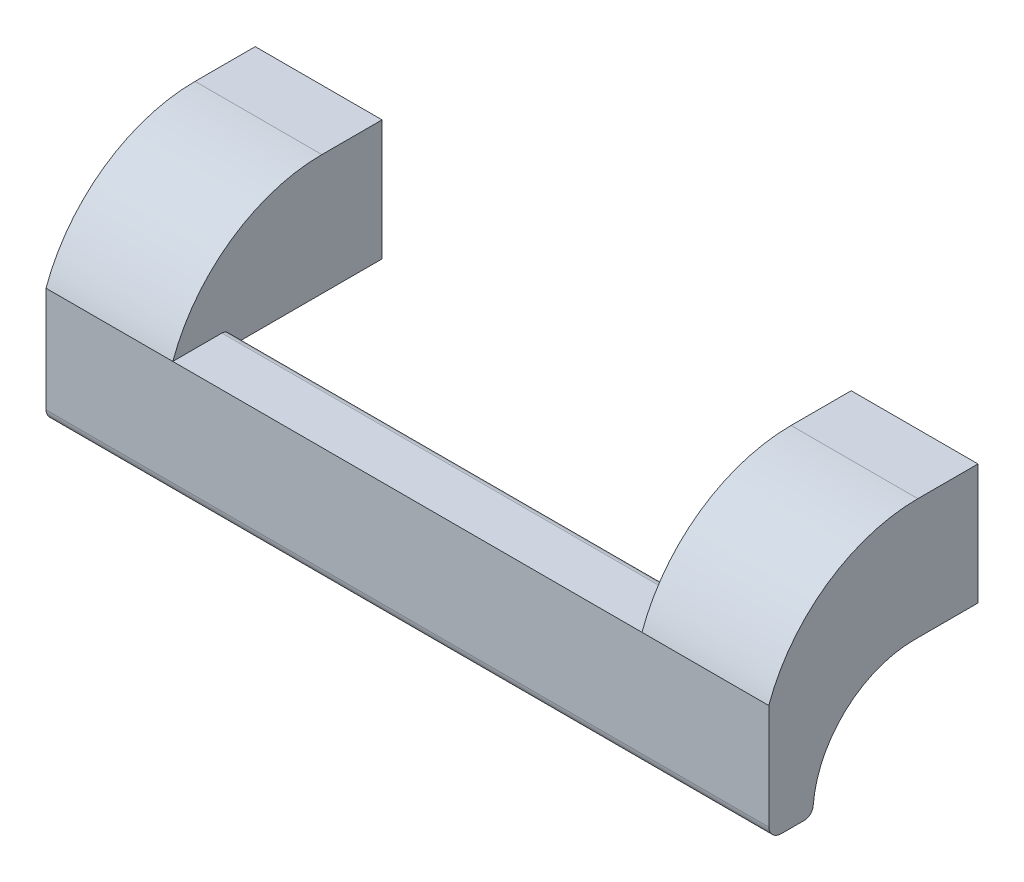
ISO-10303-21;
HEADER;
FILE_DESCRIPTION(('STEP AP214'),'2;1');
FILE_NAME('part.step','',(''),(''),'','','');
FILE_SCHEMA(('AUTOMOTIVE_DESIGN { 1 0 10303 214 1 1 1 1 }'));
ENDSEC;
DATA;
#1=APPLICATION_CONTEXT('core data for automotive mechanical design processes');
#2=APPLICATION_PROTOCOL_DEFINITION('international standard','automotive_design',2000,#1);
#3=PRODUCT_CONTEXT('',#1,'mechanical');
#4=PRODUCT('Part','Part','',(#3));
#5=PRODUCT_RELATED_PRODUCT_CATEGORY('part','',(#4));
#6=PRODUCT_DEFINITION_FORMATION('','',#4);
#7=PRODUCT_DEFINITION_CONTEXT('part definition',#1,'design');
#8=PRODUCT_DEFINITION('design','',#6,#7);
#9=PRODUCT_DEFINITION_SHAPE('','',#8);
#10=(LENGTH_UNIT() NAMED_UNIT(*) SI_UNIT(.MILLI.,.METRE.));
#11=(NAMED_UNIT(*) PLANE_ANGLE_UNIT() SI_UNIT($,.RADIAN.));
#12=(NAMED_UNIT(*) SI_UNIT($,.STERADIAN.) SOLID_ANGLE_UNIT());
#13=UNCERTAINTY_MEASURE_WITH_UNIT(LENGTH_MEASURE(1.E-05),#10,'distance_accuracy_value','');
#14=(GEOMETRIC_REPRESENTATION_CONTEXT(3) GLOBAL_UNCERTAINTY_ASSIGNED_CONTEXT((#13)) GLOBAL_UNIT_ASSIGNED_CONTEXT((#10,
#11,#12)) REPRESENTATION_CONTEXT('',''));
#15=CARTESIAN_POINT('',(0.,0.,0.));
#16=DIRECTION('',(0.,0.,1.));
#17=DIRECTION('',(1.,0.,0.));
#18=AXIS2_PLACEMENT_3D('',#15,#16,#17);
#19=CARTESIAN_POINT('',(-10.25,-9.49999999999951,1.94289029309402E-13));
#20=DIRECTION('',(0.,0.,-1.));
#21=DIRECTION('',(1.,0.,0.));
#22=AXIS2_PLACEMENT_3D('',#19,#20,#21);
#23=PLANE('',#22);
#24=DIRECTION('',(1.,0.,0.));
#25=VECTOR('',#24,1.);
#26=CARTESIAN_POINT('',(-10.25,-9.49999999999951,1.94289029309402E-13));
#27=LINE('',#26,#25);
#28=CARTESIAN_POINT('',(83.75,-9.49999999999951,1.94289029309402E-13));
#29=VERTEX_POINT('',#28);
#30=CARTESIAN_POINT('',(103.75,-9.49999999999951,1.94289029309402E-13));
#31=VERTEX_POINT('',#30);
#32=EDGE_CURVE('E184',#29,#31,#27,.T.);
#33=ORIENTED_EDGE('',*,*,#32,.F.);
#34=DIRECTION('',(0.,-1.,0.));
#35=VECTOR('',#34,1.);
#36=CARTESIAN_POINT('',(83.75,10.763352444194,-2.08166817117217E-13));
#37=LINE('',#36,#35);
#38=CARTESIAN_POINT('',(83.75,9.5,-1.80411241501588E-13));
#39=VERTEX_POINT('',#38);
#40=EDGE_CURVE('E359',#39,#29,#37,.T.);
#41=ORIENTED_EDGE('',*,*,#40,.F.);
#42=DIRECTION('',(1.,0.,0.));
#43=VECTOR('',#42,1.);
#44=CARTESIAN_POINT('',(-10.25,9.5,-1.80411241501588E-13));
#45=LINE('',#44,#43);
#46=CARTESIAN_POINT('',(103.75,9.5,-1.80411241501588E-13));
#47=VERTEX_POINT('',#46);
#48=EDGE_CURVE('E183',#39,#47,#45,.T.);
#49=ORIENTED_EDGE('',*,*,#48,.T.);
#50=DIRECTION('',(0.,1.,0.));
#51=VECTOR('',#50,1.);
#52=CARTESIAN_POINT('',(103.75,-9.49999999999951,1.94289029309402E-13));
#53=LINE('',#52,#51);
#54=EDGE_CURVE('E215',#31,#47,#53,.T.);
#55=ORIENTED_EDGE('',*,*,#54,.F.);
#56=EDGE_LOOP('',(#33,#41,#49,#55));
#57=FACE_BOUND('',#56,.T.);
#58=CARTESIAN_POINT('',(93.5,0.,0.));
#59=DIRECTION('',(0.,0.,1.));
#60=DIRECTION('',(-1.,0.,0.));
#61=AXIS2_PLACEMENT_3D('',#58,#59,#60);
#62=CIRCLE('',#61,3.25);
#63=CARTESIAN_POINT('',(90.25,0.,0.));
#64=VERTEX_POINT('',#63);
#65=EDGE_CURVE('E371',#64,#64,#62,.T.);
#66=ORIENTED_EDGE('',*,*,#65,.T.);
#67=EDGE_LOOP('',(#66));
#68=FACE_BOUND('',#67,.T.);
#69=ADVANCED_FACE('F14',(#57,#68),#23,.T.);
#70=DIRECTION('',(0.,-1.,0.));
#71=VECTOR('',#70,1.);
#72=CARTESIAN_POINT('',(9.75,10.763352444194,-2.08166817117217E-13));
#73=LINE('',#72,#71);
#74=CARTESIAN_POINT('',(9.75,9.5,-1.80411241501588E-13));
#75=VERTEX_POINT('',#74);
#76=CARTESIAN_POINT('',(9.75,-9.49999999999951,1.94289029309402E-13));
#77=VERTEX_POINT('',#76);
#78=EDGE_CURVE('E160',#75,#77,#73,.T.);
#79=ORIENTED_EDGE('',*,*,#78,.T.);
#80=CARTESIAN_POINT('',(-10.25,-9.49999999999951,1.94289029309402E-13));
#81=VERTEX_POINT('',#80);
#82=EDGE_CURVE('E173',#81,#77,#27,.T.);
#83=ORIENTED_EDGE('',*,*,#82,.F.);
#84=DIRECTION('',(0.,1.,0.));
#85=VECTOR('',#84,1.);
#86=CARTESIAN_POINT('',(-10.25,-9.49999999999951,1.94289029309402E-13));
#87=LINE('',#86,#85);
#88=CARTESIAN_POINT('',(-10.25,9.5,-1.80411241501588E-13));
#89=VERTEX_POINT('',#88);
#90=EDGE_CURVE('E243',#81,#89,#87,.T.);
#91=ORIENTED_EDGE('',*,*,#90,.T.);
#92=EDGE_CURVE('E175',#89,#75,#45,.T.);
#93=ORIENTED_EDGE('',*,*,#92,.T.);
#94=EDGE_LOOP('',(#79,#83,#91,#93));
#95=FACE_BOUND('',#94,.T.);
#96=CARTESIAN_POINT('',(0.,0.,0.));
#97=DIRECTION('',(0.,0.,-1.));
#98=DIRECTION('',(1.,0.,0.));
#99=AXIS2_PLACEMENT_3D('',#96,#97,#98);
#100=CIRCLE('',#99,3.25);
#101=CARTESIAN_POINT('',(3.25,0.,0.));
#102=VERTEX_POINT('',#101);
#103=EDGE_CURVE('E176',#102,#102,#100,.T.);
#104=ORIENTED_EDGE('',*,*,#103,.F.);
#105=EDGE_LOOP('',(#104));
#106=FACE_BOUND('',#105,.T.);
#107=ADVANCED_FACE('F170',(#95,#106),#23,.T.);
#108=CARTESIAN_POINT('',(-10.25,-15.4999999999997,9.48936410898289));
#109=DIRECTION('',(1.,0.,0.));
#110=DIRECTION('',(0.,1.,0.));
#111=AXIS2_PLACEMENT_3D('',#108,#109,#110);
#112=CYLINDRICAL_SURFACE('',#111,25.);
#113=CARTESIAN_POINT('',(83.75,-15.4999999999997,9.48936410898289));
#114=DIRECTION('',(-1.,0.,0.));
#115=DIRECTION('',(0.,-1.,0.));
#116=AXIS2_PLACEMENT_3D('',#113,#114,#115);
#117=CIRCLE('',#116,25.);
#118=CARTESIAN_POINT('',(83.75,-6.99999999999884,33.0000000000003));
#119=VERTEX_POINT('',#118);
#120=CARTESIAN_POINT('',(83.75,9.50000000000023,9.48936410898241));
#121=VERTEX_POINT('',#120);
#122=EDGE_CURVE('E340',#119,#121,#117,.T.);
#123=ORIENTED_EDGE('',*,*,#122,.F.);
#124=DIRECTION('',(1.,0.,0.));
#125=VECTOR('',#124,1.);
#126=CARTESIAN_POINT('',(-10.25,-6.99999999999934,33.0000000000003));
#127=LINE('',#126,#125);
#128=CARTESIAN_POINT('',(103.75,-6.99999999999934,33.0000000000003));
#129=VERTEX_POINT('',#128);
#130=EDGE_CURVE('E206',#119,#129,#127,.T.);
#131=ORIENTED_EDGE('',*,*,#130,.T.);
#132=CARTESIAN_POINT('',(103.75,-15.4999999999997,9.48936410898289));
#133=DIRECTION('',(-1.,0.,0.));
#134=DIRECTION('',(0.,-1.,0.));
#135=AXIS2_PLACEMENT_3D('',#132,#133,#134);
#136=CIRCLE('',#135,25.);
#137=CARTESIAN_POINT('',(103.75,9.50000000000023,9.48936410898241));
#138=VERTEX_POINT('',#137);
#139=EDGE_CURVE('E203',#129,#138,#136,.T.);
#140=ORIENTED_EDGE('',*,*,#139,.T.);
#141=DIRECTION('',(1.,0.,0.));
#142=VECTOR('',#141,1.);
#143=CARTESIAN_POINT('',(-10.25,9.50000000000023,9.48936410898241));
#144=LINE('',#143,#142);
#145=EDGE_CURVE('E22',#121,#138,#144,.T.);
#146=ORIENTED_EDGE('',*,*,#145,.F.);
#147=EDGE_LOOP('',(#123,#131,#140,#146));
#148=FACE_BOUND('',#147,.T.);
#149=ADVANCED_FACE('F204',(#148),#112,.T.);
#150=CARTESIAN_POINT('',(-10.25,9.5,-1.80411241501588E-13));
#151=DIRECTION('',(0.,1.,0.));
#152=DIRECTION('',(-1.,0.,0.));
#153=AXIS2_PLACEMENT_3D('',#150,#151,#152);
#154=PLANE('',#153);
#155=ORIENTED_EDGE('',*,*,#48,.F.);
#156=DIRECTION('',(0.,0.,1.));
#157=VECTOR('',#156,1.);
#158=CARTESIAN_POINT('',(83.75,9.5,-1.80411241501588E-13));
#159=LINE('',#158,#157);
#160=EDGE_CURVE('E199',#39,#121,#159,.T.);
#161=ORIENTED_EDGE('',*,*,#160,.T.);
#162=ORIENTED_EDGE('',*,*,#145,.T.);
#163=DIRECTION('',(0.,0.,1.));
#164=VECTOR('',#163,1.);
#165=CARTESIAN_POINT('',(103.75,9.5,-1.80411241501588E-13));
#166=LINE('',#165,#164);
#167=EDGE_CURVE('E197',#47,#138,#166,.T.);
#168=ORIENTED_EDGE('',*,*,#167,.F.);
#169=EDGE_LOOP('',(#155,#161,#162,#168));
#170=FACE_BOUND('',#169,.T.);
#171=ADVANCED_FACE('F195',(#170),#154,.T.);
#172=CARTESIAN_POINT('',(-10.25,-9.49999999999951,1.94289029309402E-13));
#173=DIRECTION('',(0.,1.,0.));
#174=DIRECTION('',(-1.,0.,0.));
#175=AXIS2_PLACEMENT_3D('',#172,#173,#174);
#176=PLANE('',#175);
#177=DIRECTION('',(0.,0.,-1.));
#178=VECTOR('',#177,1.);
#179=CARTESIAN_POINT('',(83.75,-9.49999999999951,25.2545902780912));
#180=LINE('',#179,#178);
#181=CARTESIAN_POINT('',(83.75,-9.49999999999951,25.2545902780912));
#182=VERTEX_POINT('',#181);
#183=EDGE_CURVE('E357',#182,#29,#180,.T.);
#184=ORIENTED_EDGE('',*,*,#183,.T.);
#185=ORIENTED_EDGE('',*,*,#32,.T.);
#186=DIRECTION('',(0.,0.,1.));
#187=VECTOR('',#186,1.);
#188=CARTESIAN_POINT('',(103.75,-9.49999999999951,1.94289029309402E-13));
#189=LINE('',#188,#187);
#190=CARTESIAN_POINT('',(103.75,-9.49999999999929,10.0519430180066));
#191=VERTEX_POINT('',#190);
#192=EDGE_CURVE('E217',#31,#191,#189,.T.);
#193=ORIENTED_EDGE('',*,*,#192,.T.);
#194=DIRECTION('',(1.,0.,0.));
#195=VECTOR('',#194,1.);
#196=CARTESIAN_POINT('',(-10.25,-9.49999999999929,10.0519430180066));
#197=LINE('',#196,#195);
#198=CARTESIAN_POINT('',(101.25,-9.49999999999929,10.0519430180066));
#199=VERTEX_POINT('',#198);
#200=EDGE_CURVE('E273',#199,#191,#197,.T.);
#201=ORIENTED_EDGE('',*,*,#200,.F.);
#202=DIRECTION('',(0.,0.,1.));
#203=VECTOR('',#202,1.);
#204=CARTESIAN_POINT('',(101.25,-9.49999999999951,-0.00996209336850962));
#205=LINE('',#204,#203);
#206=CARTESIAN_POINT('',(101.25,-9.4999999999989,30.0000000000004));
#207=VERTEX_POINT('',#206);
#208=EDGE_CURVE('E325',#199,#207,#205,.T.);
#209=ORIENTED_EDGE('',*,*,#208,.T.);
#210=DIRECTION('',(-1.,0.,0.));
#211=VECTOR('',#210,1.);
#212=CARTESIAN_POINT('',(101.25,-9.4999999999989,30.0000000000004));
#213=LINE('',#212,#211);
#214=CARTESIAN_POINT('',(-7.75,-9.4999999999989,30.0000000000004));
#215=VERTEX_POINT('',#214);
#216=EDGE_CURVE('E303',#207,#215,#213,.T.);
#217=ORIENTED_EDGE('',*,*,#216,.T.);
#218=DIRECTION('',(0.,0.,1.));
#219=VECTOR('',#218,1.);
#220=CARTESIAN_POINT('',(-7.75,-9.49999999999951,-0.00996209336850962));
#221=LINE('',#220,#219);
#222=CARTESIAN_POINT('',(-7.75,-9.49999999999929,10.0519430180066));
#223=VERTEX_POINT('',#222);
#224=EDGE_CURVE('E338',#223,#215,#221,.T.);
#225=ORIENTED_EDGE('',*,*,#224,.F.);
#226=CARTESIAN_POINT('',(-10.25,-9.49999999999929,10.0519430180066));
#227=VERTEX_POINT('',#226);
#228=EDGE_CURVE('E186',#227,#223,#197,.T.);
#229=ORIENTED_EDGE('',*,*,#228,.F.);
#230=DIRECTION('',(0.,0.,1.));
#231=VECTOR('',#230,1.);
#232=CARTESIAN_POINT('',(-10.25,-9.49999999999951,1.94289029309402E-13));
#233=LINE('',#232,#231);
#234=EDGE_CURVE('E182',#81,#227,#233,.T.);
#235=ORIENTED_EDGE('',*,*,#234,.F.);
#236=ORIENTED_EDGE('',*,*,#82,.T.);
#237=DIRECTION('',(0.,0.,-1.));
#238=VECTOR('',#237,1.);
#239=CARTESIAN_POINT('',(9.75,-9.49999999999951,25.2545902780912));
#240=LINE('',#239,#238);
#241=CARTESIAN_POINT('',(9.75,-9.49999999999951,25.2545902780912));
#242=VERTEX_POINT('',#241);
#243=EDGE_CURVE('E157',#242,#77,#240,.T.);
#244=ORIENTED_EDGE('',*,*,#243,.F.);
#245=DIRECTION('',(-1.,0.,0.));
#246=VECTOR('',#245,1.);
#247=CARTESIAN_POINT('',(83.75,-9.49999999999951,25.2545902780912));
#248=LINE('',#247,#246);
#249=EDGE_CURVE('E350',#182,#242,#248,.T.);
#250=ORIENTED_EDGE('',*,*,#249,.F.);
#251=EDGE_LOOP('',(#184,#185,#193,#201,#209,#217,#225,#229,#235,#236,#244,#250));
#252=FACE_BOUND('',#251,.T.);
#253=ADVANCED_FACE('F180',(#252),#176,.F.);
#254=CARTESIAN_POINT('',(-10.25,-25.4999999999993,10.0519430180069));
#255=DIRECTION('',(1.,0.,0.));
#256=DIRECTION('',(0.,1.,0.));
#257=AXIS2_PLACEMENT_3D('',#254,#255,#256);
#258=CYLINDRICAL_SURFACE('',#257,16.);
#259=DIRECTION('',(1.,0.,0.));
#260=VECTOR('',#259,1.);
#261=CARTESIAN_POINT('',(-10.25,-24.2117925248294,26.0000000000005));
#262=LINE('',#261,#260);
#263=CARTESIAN_POINT('',(101.25,-24.2117925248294,26.0000000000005));
#264=VERTEX_POINT('',#263);
#265=CARTESIAN_POINT('',(103.75,-24.2117925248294,26.0000000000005));
#266=VERTEX_POINT('',#265);
#267=EDGE_CURVE('E270',#264,#266,#262,.T.);
#268=ORIENTED_EDGE('',*,*,#267,.F.);
#269=CARTESIAN_POINT('',(101.25,-25.4999999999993,10.0519430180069));
#270=DIRECTION('',(-1.,0.,0.));
#271=DIRECTION('',(0.,-1.,0.));
#272=AXIS2_PLACEMENT_3D('',#269,#270,#271);
#273=CIRCLE('',#272,16.);
#274=EDGE_CURVE('E210',#264,#199,#273,.T.);
#275=ORIENTED_EDGE('',*,*,#274,.T.);
#276=ORIENTED_EDGE('',*,*,#200,.T.);
#277=CARTESIAN_POINT('',(103.75,-25.4999999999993,10.0519430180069));
#278=DIRECTION('',(-1.,0.,0.));
#279=DIRECTION('',(0.,-1.,0.));
#280=AXIS2_PLACEMENT_3D('',#277,#278,#279);
#281=CIRCLE('',#280,16.);
#282=EDGE_CURVE('E223',#266,#191,#281,.T.);
#283=ORIENTED_EDGE('',*,*,#282,.F.);
#284=EDGE_LOOP('',(#268,#275,#276,#283));
#285=FACE_BOUND('',#284,.T.);
#286=ADVANCED_FACE('F285',(#285),#258,.F.);
#287=CARTESIAN_POINT('',(-10.25,-6.99999999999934,33.0000000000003));
#288=VERTEX_POINT('',#287);
#289=CARTESIAN_POINT('',(9.75,-6.99999999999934,33.0000000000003));
#290=VERTEX_POINT('',#289);
#291=EDGE_CURVE('E261',#288,#290,#127,.T.);
#292=ORIENTED_EDGE('',*,*,#291,.T.);
#293=CARTESIAN_POINT('',(9.75,-15.4999999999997,9.48936410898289));
#294=DIRECTION('',(-1.,0.,0.));
#295=DIRECTION('',(0.,-1.,0.));
#296=AXIS2_PLACEMENT_3D('',#293,#294,#295);
#297=CIRCLE('',#296,25.);
#298=CARTESIAN_POINT('',(9.75,9.50000000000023,9.48936410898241));
#299=VERTEX_POINT('',#298);
#300=EDGE_CURVE('E343',#290,#299,#297,.T.);
#301=ORIENTED_EDGE('',*,*,#300,.T.);
#302=CARTESIAN_POINT('',(-10.25,9.50000000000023,9.48936410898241));
#303=VERTEX_POINT('',#302);
#304=EDGE_CURVE('E9',#303,#299,#144,.T.);
#305=ORIENTED_EDGE('',*,*,#304,.F.);
#306=CARTESIAN_POINT('',(-10.25,-15.4999999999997,9.48936410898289));
#307=DIRECTION('',(-1.,0.,0.));
#308=DIRECTION('',(0.,-1.,0.));
#309=AXIS2_PLACEMENT_3D('',#306,#307,#308);
#310=CIRCLE('',#309,25.);
#311=EDGE_CURVE('E237',#288,#303,#310,.T.);
#312=ORIENTED_EDGE('',*,*,#311,.F.);
#313=EDGE_LOOP('',(#292,#301,#305,#312));
#314=FACE_BOUND('',#313,.T.);
#315=ADVANCED_FACE('F417',(#314),#112,.T.);
#316=DIRECTION('',(0.,0.,1.));
#317=VECTOR('',#316,1.);
#318=CARTESIAN_POINT('',(9.75,9.5,-1.80411241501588E-13));
#319=LINE('',#318,#317);
#320=EDGE_CURVE('E346',#75,#299,#319,.T.);
#321=ORIENTED_EDGE('',*,*,#320,.F.);
#322=ORIENTED_EDGE('',*,*,#92,.F.);
#323=DIRECTION('',(0.,0.,1.));
#324=VECTOR('',#323,1.);
#325=CARTESIAN_POINT('',(-10.25,9.5,-1.80411241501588E-13));
#326=LINE('',#325,#324);
#327=EDGE_CURVE('E240',#89,#303,#326,.T.);
#328=ORIENTED_EDGE('',*,*,#327,.T.);
#329=ORIENTED_EDGE('',*,*,#304,.T.);
#330=EDGE_LOOP('',(#321,#322,#328,#329));
#331=FACE_BOUND('',#330,.T.);
#332=ADVANCED_FACE('F16',(#331),#154,.T.);
#333=CARTESIAN_POINT('',(-7.75,-25.4999999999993,10.0519430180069));
#334=DIRECTION('',(-1.,0.,0.));
#335=DIRECTION('',(0.,-1.,0.));
#336=AXIS2_PLACEMENT_3D('',#333,#334,#335);
#337=CIRCLE('',#336,16.);
#338=CARTESIAN_POINT('',(-7.75,-24.2117925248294,26.));
#339=VERTEX_POINT('',#338);
#340=EDGE_CURVE('E299',#339,#223,#337,.T.);
#341=ORIENTED_EDGE('',*,*,#340,.F.);
#342=CARTESIAN_POINT('',(-10.25,-24.2117925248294,26.0000000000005));
#343=VERTEX_POINT('',#342);
#344=EDGE_CURVE('E271',#343,#339,#262,.T.);
#345=ORIENTED_EDGE('',*,*,#344,.F.);
#346=CARTESIAN_POINT('',(-10.25,-25.4999999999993,10.0519430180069));
#347=DIRECTION('',(-1.,0.,0.));
#348=DIRECTION('',(0.,-1.,0.));
#349=AXIS2_PLACEMENT_3D('',#346,#347,#348);
#350=CIRCLE('',#349,16.);
#351=EDGE_CURVE('E246',#343,#227,#350,.T.);
#352=ORIENTED_EDGE('',*,*,#351,.T.);
#353=ORIENTED_EDGE('',*,*,#228,.T.);
#354=EDGE_LOOP('',(#341,#345,#352,#353));
#355=FACE_BOUND('',#354,.T.);
#356=ADVANCED_FACE('F298',(#355),#258,.F.);
#357=CARTESIAN_POINT('',(-10.25,-24.0989933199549,27.3964583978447));
#358=DIRECTION('',(1.,0.,0.));
#359=DIRECTION('',(0.,1.,0.));
#360=AXIS2_PLACEMENT_3D('',#357,#358,#359);
#361=CYLINDRICAL_SURFACE('',#360,1.40100668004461);
#362=DIRECTION('',(1.,0.,0.));
#363=VECTOR('',#362,1.);
#364=CARTESIAN_POINT('',(-10.25,-25.4999999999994,27.3964583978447));
#365=LINE('',#364,#363);
#366=CARTESIAN_POINT('',(-10.25,-25.4999999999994,27.3964583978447));
#367=VERTEX_POINT('',#366);
#368=CARTESIAN_POINT('',(103.75,-25.4999999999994,27.3964583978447));
#369=VERTEX_POINT('',#368);
#370=EDGE_CURVE('E269',#367,#369,#365,.T.);
#371=ORIENTED_EDGE('',*,*,#370,.F.);
#372=CARTESIAN_POINT('',(-10.25,-24.0989933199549,27.3964583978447));
#373=DIRECTION('',(-1.,0.,0.));
#374=DIRECTION('',(0.,-1.,0.));
#375=AXIS2_PLACEMENT_3D('',#372,#373,#374);
#376=CIRCLE('',#375,1.40100668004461);
#377=EDGE_CURVE('E249',#343,#367,#376,.T.);
#378=ORIENTED_EDGE('',*,*,#377,.F.);
#379=ORIENTED_EDGE('',*,*,#344,.T.);
#380=DIRECTION('',(-1.,0.,0.));
#381=VECTOR('',#380,1.);
#382=CARTESIAN_POINT('',(101.25,-24.2117925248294,26.));
#383=LINE('',#382,#381);
#384=EDGE_CURVE('E282',#264,#339,#383,.T.);
#385=ORIENTED_EDGE('',*,*,#384,.F.);
#386=ORIENTED_EDGE('',*,*,#267,.T.);
#387=CARTESIAN_POINT('',(103.75,-24.0989933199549,27.3964583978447));
#388=DIRECTION('',(-1.,0.,0.));
#389=DIRECTION('',(0.,-1.,0.));
#390=AXIS2_PLACEMENT_3D('',#387,#388,#389);
#391=CIRCLE('',#390,1.40100668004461);
#392=EDGE_CURVE('E226',#266,#369,#391,.T.);
#393=ORIENTED_EDGE('',*,*,#392,.T.);
#394=EDGE_LOOP('',(#371,#378,#379,#385,#386,#393));
#395=FACE_BOUND('',#394,.T.);
#396=ADVANCED_FACE('F279',(#395),#361,.T.);
#397=CARTESIAN_POINT('',(-10.25,-25.4999999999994,27.3964583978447));
#398=DIRECTION('',(0.,1.,0.));
#399=DIRECTION('',(-1.,0.,0.));
#400=AXIS2_PLACEMENT_3D('',#397,#398,#399);
#401=PLANE('',#400);
#402=DIRECTION('',(1.,0.,0.));
#403=VECTOR('',#402,1.);
#404=CARTESIAN_POINT('',(-10.25,-25.4999999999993,31.0031268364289));
#405=LINE('',#404,#403);
#406=CARTESIAN_POINT('',(-10.25,-25.4999999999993,31.0031268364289));
#407=VERTEX_POINT('',#406);
#408=CARTESIAN_POINT('',(103.75,-25.4999999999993,31.0031268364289));
#409=VERTEX_POINT('',#408);
#410=EDGE_CURVE('E267',#407,#409,#405,.T.);
#411=ORIENTED_EDGE('',*,*,#410,.F.);
#412=DIRECTION('',(0.,0.,1.));
#413=VECTOR('',#412,1.);
#414=CARTESIAN_POINT('',(-10.25,-25.4999999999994,27.3964583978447));
#415=LINE('',#414,#413);
#416=EDGE_CURVE('E252',#367,#407,#415,.T.);
#417=ORIENTED_EDGE('',*,*,#416,.F.);
#418=ORIENTED_EDGE('',*,*,#370,.T.);
#419=DIRECTION('',(0.,0.,1.));
#420=VECTOR('',#419,1.);
#421=CARTESIAN_POINT('',(103.75,-25.4999999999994,27.3964583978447));
#422=LINE('',#421,#420);
#423=EDGE_CURVE('E229',#369,#409,#422,.T.);
#424=ORIENTED_EDGE('',*,*,#423,.T.);
#425=EDGE_LOOP('',(#411,#417,#418,#424));
#426=FACE_BOUND('',#425,.T.);
#427=ADVANCED_FACE('F289',(#426),#401,.F.);
#428=CARTESIAN_POINT('',(-10.25,-23.4999999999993,31.0031268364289));
#429=DIRECTION('',(1.,0.,0.));
#430=DIRECTION('',(0.,1.,0.));
#431=AXIS2_PLACEMENT_3D('',#428,#429,#430);
#432=CYLINDRICAL_SURFACE('',#431,2.00000000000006);
#433=DIRECTION('',(1.,0.,0.));
#434=VECTOR('',#433,1.);
#435=CARTESIAN_POINT('',(-10.25,-23.6117925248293,33.0000000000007));
#436=LINE('',#435,#434);
#437=CARTESIAN_POINT('',(-10.25,-23.6117925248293,33.0000000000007));
#438=VERTEX_POINT('',#437);
#439=CARTESIAN_POINT('',(103.75,-23.6117925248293,33.0000000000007));
#440=VERTEX_POINT('',#439);
#441=EDGE_CURVE('E264',#438,#440,#436,.T.);
#442=ORIENTED_EDGE('',*,*,#441,.F.);
#443=CARTESIAN_POINT('',(-10.25,-23.4999999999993,31.0031268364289));
#444=DIRECTION('',(-1.,0.,0.));
#445=DIRECTION('',(0.,-1.,0.));
#446=AXIS2_PLACEMENT_3D('',#443,#444,#445);
#447=CIRCLE('',#446,2.00000000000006);
#448=EDGE_CURVE('E255',#407,#438,#447,.T.);
#449=ORIENTED_EDGE('',*,*,#448,.F.);
#450=ORIENTED_EDGE('',*,*,#410,.T.);
#451=CARTESIAN_POINT('',(103.75,-23.4999999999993,31.0031268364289));
#452=DIRECTION('',(-1.,0.,0.));
#453=DIRECTION('',(0.,-1.,0.));
#454=AXIS2_PLACEMENT_3D('',#451,#452,#453);
#455=CIRCLE('',#454,2.00000000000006);
#456=EDGE_CURVE('E232',#409,#440,#455,.T.);
#457=ORIENTED_EDGE('',*,*,#456,.T.);
#458=EDGE_LOOP('',(#442,#449,#450,#457));
#459=FACE_BOUND('',#458,.T.);
#460=ADVANCED_FACE('F409',(#459),#432,.T.);
#461=CARTESIAN_POINT('',(-10.25,-23.6117925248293,33.0000000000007));
#462=DIRECTION('',(0.,0.,-1.));
#463=DIRECTION('',(1.,0.,0.));
#464=AXIS2_PLACEMENT_3D('',#461,#462,#463);
#465=PLANE('',#464);
#466=DIRECTION('',(0.,1.,0.));
#467=VECTOR('',#466,1.);
#468=CARTESIAN_POINT('',(-10.25,-23.6117925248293,33.0000000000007));
#469=LINE('',#468,#467);
#470=EDGE_CURVE('E258',#438,#288,#469,.T.);
#471=ORIENTED_EDGE('',*,*,#470,.F.);
#472=ORIENTED_EDGE('',*,*,#441,.T.);
#473=DIRECTION('',(0.,1.,0.));
#474=VECTOR('',#473,1.);
#475=CARTESIAN_POINT('',(103.75,-23.6117925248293,33.0000000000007));
#476=LINE('',#475,#474);
#477=EDGE_CURVE('E235',#440,#129,#476,.T.);
#478=ORIENTED_EDGE('',*,*,#477,.T.);
#479=ORIENTED_EDGE('',*,*,#130,.F.);
#480=EDGE_CURVE('E265',#290,#119,#127,.T.);
#481=ORIENTED_EDGE('',*,*,#480,.F.);
#482=ORIENTED_EDGE('',*,*,#291,.F.);
#483=EDGE_LOOP('',(#471,#472,#478,#479,#481,#482));
#484=FACE_BOUND('',#483,.T.);
#485=ADVANCED_FACE('F412',(#484),#465,.F.);
#486=CARTESIAN_POINT('',(-10.25,-15.4999999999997,9.48936410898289));
#487=DIRECTION('',(-1.,0.,0.));
#488=DIRECTION('',(0.,-1.,0.));
#489=AXIS2_PLACEMENT_3D('',#486,#487,#488);
#490=PLANE('',#489);
#491=ORIENTED_EDGE('',*,*,#311,.T.);
#492=ORIENTED_EDGE('',*,*,#327,.F.);
#493=ORIENTED_EDGE('',*,*,#90,.F.);
#494=ORIENTED_EDGE('',*,*,#234,.T.);
#495=ORIENTED_EDGE('',*,*,#351,.F.);
#496=ORIENTED_EDGE('',*,*,#377,.T.);
#497=ORIENTED_EDGE('',*,*,#416,.T.);
#498=ORIENTED_EDGE('',*,*,#448,.T.);
#499=ORIENTED_EDGE('',*,*,#470,.T.);
#500=EDGE_LOOP('',(#491,#492,#493,#494,#495,#496,#497,#498,#499));
#501=FACE_BOUND('',#500,.T.);
#502=ADVANCED_FACE('F293',(#501),#490,.T.);
#503=CARTESIAN_POINT('',(103.75,-15.4999999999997,9.48936410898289));
#504=DIRECTION('',(-1.,0.,0.));
#505=DIRECTION('',(0.,-1.,0.));
#506=AXIS2_PLACEMENT_3D('',#503,#504,#505);
#507=PLANE('',#506);
#508=ORIENTED_EDGE('',*,*,#139,.F.);
#509=ORIENTED_EDGE('',*,*,#477,.F.);
#510=ORIENTED_EDGE('',*,*,#456,.F.);
#511=ORIENTED_EDGE('',*,*,#423,.F.);
#512=ORIENTED_EDGE('',*,*,#392,.F.);
#513=ORIENTED_EDGE('',*,*,#282,.T.);
#514=ORIENTED_EDGE('',*,*,#192,.F.);
#515=ORIENTED_EDGE('',*,*,#54,.T.);
#516=ORIENTED_EDGE('',*,*,#167,.T.);
#517=EDGE_LOOP('',(#508,#509,#510,#511,#512,#513,#514,#515,#516));
#518=FACE_BOUND('',#517,.T.);
#519=ADVANCED_FACE('F212',(#518),#507,.F.);
#520=CARTESIAN_POINT('',(101.25,-22.9999999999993,30.0000000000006));
#521=DIRECTION('',(0.,0.,1.));
#522=DIRECTION('',(-1.,0.,0.));
#523=AXIS2_PLACEMENT_3D('',#520,#521,#522);
#524=PLANE('',#523);
#525=DIRECTION('',(-1.,0.,0.));
#526=VECTOR('',#525,1.);
#527=CARTESIAN_POINT('',(101.25,-22.9999999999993,30.0000000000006));
#528=LINE('',#527,#526);
#529=CARTESIAN_POINT('',(101.25,-22.9999999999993,30.0000000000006));
#530=VERTEX_POINT('',#529);
#531=CARTESIAN_POINT('',(-7.75,-22.9999999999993,30.0000000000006));
#532=VERTEX_POINT('',#531);
#533=EDGE_CURVE('E306',#530,#532,#528,.T.);
#534=ORIENTED_EDGE('',*,*,#533,.T.);
#535=DIRECTION('',(0.,1.,0.));
#536=VECTOR('',#535,1.);
#537=CARTESIAN_POINT('',(-7.75,-22.9999999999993,30.0000000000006));
#538=LINE('',#537,#536);
#539=EDGE_CURVE('E335',#532,#215,#538,.T.);
#540=ORIENTED_EDGE('',*,*,#539,.T.);
#541=ORIENTED_EDGE('',*,*,#216,.F.);
#542=DIRECTION('',(0.,1.,0.));
#543=VECTOR('',#542,1.);
#544=CARTESIAN_POINT('',(101.25,-22.9999999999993,30.0000000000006));
#545=LINE('',#544,#543);
#546=EDGE_CURVE('E322',#530,#207,#545,.T.);
#547=ORIENTED_EDGE('',*,*,#546,.F.);
#548=EDGE_LOOP('',(#534,#540,#541,#547));
#549=FACE_BOUND('',#548,.T.);
#550=ADVANCED_FACE('F425',(#549),#524,.F.);
#551=CARTESIAN_POINT('',(101.25,-22.9999999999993,29.5000000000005));
#552=DIRECTION('',(-1.,0.,0.));
#553=DIRECTION('',(0.,-1.,0.));
#554=AXIS2_PLACEMENT_3D('',#551,#552,#553);
#555=CYLINDRICAL_SURFACE('',#554,0.500000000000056);
#556=DIRECTION('',(-1.,0.,0.));
#557=VECTOR('',#556,1.);
#558=CARTESIAN_POINT('',(101.25,-23.4999999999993,29.5000000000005));
#559=LINE('',#558,#557);
#560=CARTESIAN_POINT('',(101.25,-23.4999999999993,29.5000000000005));
#561=VERTEX_POINT('',#560);
#562=CARTESIAN_POINT('',(-7.75,-23.4999999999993,29.5000000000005));
#563=VERTEX_POINT('',#562);
#564=EDGE_CURVE('E310',#561,#563,#559,.T.);
#565=ORIENTED_EDGE('',*,*,#564,.T.);
#566=CARTESIAN_POINT('',(-7.75,-22.9999999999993,29.5000000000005));
#567=DIRECTION('',(-1.,0.,0.));
#568=DIRECTION('',(0.,-1.,0.));
#569=AXIS2_PLACEMENT_3D('',#566,#567,#568);
#570=CIRCLE('',#569,0.500000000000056);
#571=EDGE_CURVE('E332',#563,#532,#570,.T.);
#572=ORIENTED_EDGE('',*,*,#571,.T.);
#573=ORIENTED_EDGE('',*,*,#533,.F.);
#574=CARTESIAN_POINT('',(101.25,-22.9999999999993,29.5000000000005));
#575=DIRECTION('',(-1.,0.,0.));
#576=DIRECTION('',(0.,-1.,0.));
#577=AXIS2_PLACEMENT_3D('',#574,#575,#576);
#578=CIRCLE('',#577,0.500000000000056);
#579=EDGE_CURVE('E319',#561,#530,#578,.T.);
#580=ORIENTED_EDGE('',*,*,#579,.F.);
#581=EDGE_LOOP('',(#565,#572,#573,#580));
#582=FACE_BOUND('',#581,.T.);
#583=ADVANCED_FACE('F428',(#582),#555,.F.);
#584=CARTESIAN_POINT('',(101.25,-23.4999999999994,26.7117925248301));
#585=DIRECTION('',(0.,-1.,0.));
#586=DIRECTION('',(0.,0.,1.));
#587=AXIS2_PLACEMENT_3D('',#584,#585,#586);
#588=PLANE('',#587);
#589=DIRECTION('',(-1.,0.,0.));
#590=VECTOR('',#589,1.);
#591=CARTESIAN_POINT('',(101.25,-23.4999999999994,26.7117925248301));
#592=LINE('',#591,#590);
#593=CARTESIAN_POINT('',(101.25,-23.4999999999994,26.7117925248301));
#594=VERTEX_POINT('',#593);
#595=CARTESIAN_POINT('',(-7.75,-23.4999999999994,26.7117925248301));
#596=VERTEX_POINT('',#595);
#597=EDGE_CURVE('E312',#594,#596,#592,.T.);
#598=ORIENTED_EDGE('',*,*,#597,.T.);
#599=DIRECTION('',(0.,0.,1.));
#600=VECTOR('',#599,1.);
#601=CARTESIAN_POINT('',(-7.75,-23.4999999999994,26.7117925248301));
#602=LINE('',#601,#600);
#603=EDGE_CURVE('E329',#596,#563,#602,.T.);
#604=ORIENTED_EDGE('',*,*,#603,.T.);
#605=ORIENTED_EDGE('',*,*,#564,.F.);
#606=DIRECTION('',(0.,0.,1.));
#607=VECTOR('',#606,1.);
#608=CARTESIAN_POINT('',(101.25,-23.4999999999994,26.7117925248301));
#609=LINE('',#608,#607);
#610=EDGE_CURVE('E316',#594,#561,#609,.T.);
#611=ORIENTED_EDGE('',*,*,#610,.F.);
#612=EDGE_LOOP('',(#598,#604,#605,#611));
#613=FACE_BOUND('',#612,.T.);
#614=ADVANCED_FACE('F432',(#613),#588,.F.);
#615=CARTESIAN_POINT('',(101.25,-24.2117925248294,26.7117925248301));
#616=DIRECTION('',(-1.,0.,0.));
#617=DIRECTION('',(0.,-1.,0.));
#618=AXIS2_PLACEMENT_3D('',#615,#616,#617);
#619=CYLINDRICAL_SURFACE('',#618,0.711792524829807);
#620=CARTESIAN_POINT('',(101.25,-24.2117925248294,26.7117925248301));
#621=DIRECTION('',(-1.,0.,0.));
#622=DIRECTION('',(0.,-1.,0.));
#623=AXIS2_PLACEMENT_3D('',#620,#621,#622);
#624=CIRCLE('',#623,0.711792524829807);
#625=EDGE_CURVE('E37',#594,#264,#624,.T.);
#626=ORIENTED_EDGE('',*,*,#625,.T.);
#627=ORIENTED_EDGE('',*,*,#384,.T.);
#628=CARTESIAN_POINT('',(-7.75,-24.2117925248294,26.7117925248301));
#629=DIRECTION('',(-1.,0.,0.));
#630=DIRECTION('',(0.,-1.,0.));
#631=AXIS2_PLACEMENT_3D('',#628,#629,#630);
#632=CIRCLE('',#631,0.711792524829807);
#633=EDGE_CURVE('E327',#596,#339,#632,.T.);
#634=ORIENTED_EDGE('',*,*,#633,.F.);
#635=ORIENTED_EDGE('',*,*,#597,.F.);
#636=EDGE_LOOP('',(#626,#627,#634,#635));
#637=FACE_BOUND('',#636,.T.);
#638=ADVANCED_FACE('F436',(#637),#619,.T.);
#639=CARTESIAN_POINT('',(101.25,-22.9999999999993,29.5000000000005));
#640=DIRECTION('',(-1.,0.,0.));
#641=DIRECTION('',(0.,-1.,0.));
#642=AXIS2_PLACEMENT_3D('',#639,#640,#641);
#643=PLANE('',#642);
#644=ORIENTED_EDGE('',*,*,#625,.F.);
#645=ORIENTED_EDGE('',*,*,#610,.T.);
#646=ORIENTED_EDGE('',*,*,#579,.T.);
#647=ORIENTED_EDGE('',*,*,#546,.T.);
#648=ORIENTED_EDGE('',*,*,#208,.F.);
#649=ORIENTED_EDGE('',*,*,#274,.F.);
#650=EDGE_LOOP('',(#644,#645,#646,#647,#648,#649));
#651=FACE_BOUND('',#650,.T.);
#652=ADVANCED_FACE('F438',(#651),#643,.T.);
#653=CARTESIAN_POINT('',(-7.75,-22.9999999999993,29.5000000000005));
#654=DIRECTION('',(-1.,0.,0.));
#655=DIRECTION('',(0.,-1.,0.));
#656=AXIS2_PLACEMENT_3D('',#653,#654,#655);
#657=PLANE('',#656);
#658=ORIENTED_EDGE('',*,*,#340,.T.);
#659=ORIENTED_EDGE('',*,*,#224,.T.);
#660=ORIENTED_EDGE('',*,*,#539,.F.);
#661=ORIENTED_EDGE('',*,*,#571,.F.);
#662=ORIENTED_EDGE('',*,*,#603,.F.);
#663=ORIENTED_EDGE('',*,*,#633,.T.);
#664=EDGE_LOOP('',(#658,#659,#660,#661,#662,#663));
#665=FACE_BOUND('',#664,.T.);
#666=ADVANCED_FACE('F441',(#665),#657,.F.);
#667=CARTESIAN_POINT('',(83.75,-6.99999999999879,34.0304898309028));
#668=DIRECTION('',(0.,1.,0.));
#669=DIRECTION('',(0.,0.,-1.));
#670=AXIS2_PLACEMENT_3D('',#667,#668,#669);
#671=PLANE('',#670);
#672=ORIENTED_EDGE('',*,*,#480,.T.);
#673=DIRECTION('',(0.,0.,-1.));
#674=VECTOR('',#673,1.);
#675=CARTESIAN_POINT('',(83.75,-6.99999999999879,34.0304898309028));
#676=LINE('',#675,#674);
#677=CARTESIAN_POINT('',(83.75,-6.99999999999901,25.2545902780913));
#678=VERTEX_POINT('',#677);
#679=EDGE_CURVE('E352',#119,#678,#676,.T.);
#680=ORIENTED_EDGE('',*,*,#679,.T.);
#681=DIRECTION('',(-1.,0.,0.));
#682=VECTOR('',#681,1.);
#683=CARTESIAN_POINT('',(83.75,-6.99999999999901,25.2545902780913));
#684=LINE('',#683,#682);
#685=CARTESIAN_POINT('',(9.75,-6.99999999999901,25.2545902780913));
#686=VERTEX_POINT('',#685);
#687=EDGE_CURVE('E348',#678,#686,#684,.T.);
#688=ORIENTED_EDGE('',*,*,#687,.T.);
#689=DIRECTION('',(0.,0.,-1.));
#690=VECTOR('',#689,1.);
#691=CARTESIAN_POINT('',(9.75,-6.99999999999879,34.0304898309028));
#692=LINE('',#691,#690);
#693=EDGE_CURVE('E29',#290,#686,#692,.T.);
#694=ORIENTED_EDGE('',*,*,#693,.F.);
#695=EDGE_LOOP('',(#672,#680,#688,#694));
#696=FACE_BOUND('',#695,.T.);
#697=ADVANCED_FACE('F447',(#696),#671,.T.);
#698=CARTESIAN_POINT('',(83.75,-8.24999999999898,25.2545902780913));
#699=DIRECTION('',(-1.,0.,0.));
#700=DIRECTION('',(0.,-1.,0.));
#701=AXIS2_PLACEMENT_3D('',#698,#699,#700);
#702=PLANE('',#701);
#703=ORIENTED_EDGE('',*,*,#122,.T.);
#704=ORIENTED_EDGE('',*,*,#160,.F.);
#705=ORIENTED_EDGE('',*,*,#40,.T.);
#706=ORIENTED_EDGE('',*,*,#183,.F.);
#707=CARTESIAN_POINT('',(83.75,-8.24999999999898,25.2545902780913));
#708=DIRECTION('',(-1.,0.,0.));
#709=DIRECTION('',(0.,-1.,0.));
#710=AXIS2_PLACEMENT_3D('',#707,#708,#709);
#711=CIRCLE('',#710,1.25000000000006);
#712=EDGE_CURVE('E354',#678,#182,#711,.T.);
#713=ORIENTED_EDGE('',*,*,#712,.F.);
#714=ORIENTED_EDGE('',*,*,#679,.F.);
#715=EDGE_LOOP('',(#703,#704,#705,#706,#713,#714));
#716=FACE_BOUND('',#715,.T.);
#717=ADVANCED_FACE('F450',(#716),#702,.T.);
#718=CARTESIAN_POINT('',(9.75,-8.24999999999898,25.2545902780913));
#719=DIRECTION('',(-1.,0.,0.));
#720=DIRECTION('',(0.,-1.,0.));
#721=AXIS2_PLACEMENT_3D('',#718,#719,#720);
#722=PLANE('',#721);
#723=ORIENTED_EDGE('',*,*,#693,.T.);
#724=CARTESIAN_POINT('',(9.75,-8.24999999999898,25.2545902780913));
#725=DIRECTION('',(-1.,0.,0.));
#726=DIRECTION('',(0.,-1.,0.));
#727=AXIS2_PLACEMENT_3D('',#724,#725,#726);
#728=CIRCLE('',#727,1.25000000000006);
#729=EDGE_CURVE('E163',#686,#242,#728,.T.);
#730=ORIENTED_EDGE('',*,*,#729,.T.);
#731=ORIENTED_EDGE('',*,*,#243,.T.);
#732=ORIENTED_EDGE('',*,*,#78,.F.);
#733=ORIENTED_EDGE('',*,*,#320,.T.);
#734=ORIENTED_EDGE('',*,*,#300,.F.);
#735=EDGE_LOOP('',(#723,#730,#731,#732,#733,#734));
#736=FACE_BOUND('',#735,.T.);
#737=ADVANCED_FACE('F159',(#736),#722,.F.);
#738=CARTESIAN_POINT('',(83.75,-8.24999999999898,25.2545902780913));
#739=DIRECTION('',(-1.,0.,0.));
#740=DIRECTION('',(0.,-1.,0.));
#741=AXIS2_PLACEMENT_3D('',#738,#739,#740);
#742=CYLINDRICAL_SURFACE('',#741,1.25000000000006);
#743=ORIENTED_EDGE('',*,*,#249,.T.);
#744=ORIENTED_EDGE('',*,*,#729,.F.);
#745=ORIENTED_EDGE('',*,*,#687,.F.);
#746=ORIENTED_EDGE('',*,*,#712,.T.);
#747=EDGE_LOOP('',(#743,#744,#745,#746));
#748=FACE_BOUND('',#747,.T.);
#749=ADVANCED_FACE('F451',(#748),#742,.T.);
#750=CARTESIAN_POINT('',(0.,0.,0.));
#751=DIRECTION('',(0.,0.,-1.));
#752=DIRECTION('',(1.,0.,0.));
#753=AXIS2_PLACEMENT_3D('',#750,#751,#752);
#754=CYLINDRICAL_SURFACE('',#753,3.25);
#755=ORIENTED_EDGE('',*,*,#103,.T.);
#756=EDGE_LOOP('',(#755));
#757=FACE_BOUND('',#756,.T.);
#758=CARTESIAN_POINT('',(0.,1.66533453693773E-13,7.42473922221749));
#759=DIRECTION('',(0.,0.,-1.));
#760=DIRECTION('',(1.,0.,0.));
#761=AXIS2_PLACEMENT_3D('',#758,#759,#760);
#762=CIRCLE('',#761,3.25);
#763=CARTESIAN_POINT('',(3.25,1.66533453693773E-13,7.42473922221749));
#764=VERTEX_POINT('',#763);
#765=EDGE_CURVE('E365',#764,#764,#762,.T.);
#766=ORIENTED_EDGE('',*,*,#765,.F.);
#767=EDGE_LOOP('',(#766));
#768=FACE_BOUND('',#767,.T.);
#769=ADVANCED_FACE('F454',(#757,#768),#754,.F.);
#770=CARTESIAN_POINT('',(0.,2.22044604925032E-13,11.));
#771=DIRECTION('',(0.,0.,1.));
#772=DIRECTION('',(-1.,0.,0.));
#773=AXIS2_PLACEMENT_3D('',#770,#771,#772);
#774=CONICAL_SURFACE('',#773,6.25,0.698131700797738);
#775=ORIENTED_EDGE('',*,*,#765,.T.);
#776=EDGE_LOOP('',(#775));
#777=FACE_BOUND('',#776,.T.);
#778=CARTESIAN_POINT('',(0.,2.22044604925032E-13,11.));
#779=DIRECTION('',(0.,0.,-1.));
#780=DIRECTION('',(1.,0.,0.));
#781=AXIS2_PLACEMENT_3D('',#778,#779,#780);
#782=CIRCLE('',#781,6.25);
#783=CARTESIAN_POINT('',(6.25,2.22044604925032E-13,11.));
#784=VERTEX_POINT('',#783);
#785=EDGE_CURVE('E368',#784,#784,#782,.T.);
#786=ORIENTED_EDGE('',*,*,#785,.F.);
#787=EDGE_LOOP('',(#786));
#788=FACE_BOUND('',#787,.T.);
#789=ADVANCED_FACE('F463',(#777,#788),#774,.F.);
#790=CARTESIAN_POINT('',(0.,-6.24999999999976,11.0000000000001));
#791=DIRECTION('',(0.,0.,1.));
#792=DIRECTION('',(-1.,0.,0.));
#793=AXIS2_PLACEMENT_3D('',#790,#791,#792);
#794=PLANE('',#793);
#795=ORIENTED_EDGE('',*,*,#785,.T.);
#796=EDGE_LOOP('',(#795));
#797=FACE_BOUND('',#796,.T.);
#798=ADVANCED_FACE('F467',(#797),#794,.F.);
#799=CARTESIAN_POINT('',(93.5,0.,0.));
#800=DIRECTION('',(0.,0.,-1.));
#801=DIRECTION('',(-1.,0.,0.));
#802=AXIS2_PLACEMENT_3D('',#799,#800,#801);
#803=CYLINDRICAL_SURFACE('',#802,3.25);
#804=ORIENTED_EDGE('',*,*,#65,.F.);
#805=EDGE_LOOP('',(#804));
#806=FACE_BOUND('',#805,.T.);
#807=CARTESIAN_POINT('',(93.5,1.66533453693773E-13,7.42473922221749));
#808=DIRECTION('',(0.,0.,1.));
#809=DIRECTION('',(-1.,0.,0.));
#810=AXIS2_PLACEMENT_3D('',#807,#808,#809);
#811=CIRCLE('',#810,3.25);
#812=CARTESIAN_POINT('',(90.25,1.66533453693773E-13,7.42473922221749));
#813=VERTEX_POINT('',#812);
#814=EDGE_CURVE('E374',#813,#813,#811,.T.);
#815=ORIENTED_EDGE('',*,*,#814,.T.);
#816=EDGE_LOOP('',(#815));
#817=FACE_BOUND('',#816,.T.);
#818=ADVANCED_FACE('F390',(#806,#817),#803,.F.);
#819=CARTESIAN_POINT('',(93.5,2.22044604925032E-13,11.));
#820=DIRECTION('',(0.,0.,1.));
#821=DIRECTION('',(1.,0.,0.));
#822=AXIS2_PLACEMENT_3D('',#819,#820,#821);
#823=CONICAL_SURFACE('',#822,6.25,0.698131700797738);
#824=ORIENTED_EDGE('',*,*,#814,.F.);
#825=EDGE_LOOP('',(#824));
#826=FACE_BOUND('',#825,.T.);
#827=CARTESIAN_POINT('',(93.5,2.22044604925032E-13,11.));
#828=DIRECTION('',(0.,0.,1.));
#829=DIRECTION('',(-1.,0.,0.));
#830=AXIS2_PLACEMENT_3D('',#827,#828,#829);
#831=CIRCLE('',#830,6.25);
#832=CARTESIAN_POINT('',(87.25,2.22044604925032E-13,11.));
#833=VERTEX_POINT('',#832);
#834=EDGE_CURVE('E377',#833,#833,#831,.T.);
#835=ORIENTED_EDGE('',*,*,#834,.T.);
#836=EDGE_LOOP('',(#835));
#837=FACE_BOUND('',#836,.T.);
#838=ADVANCED_FACE('F381',(#826,#837),#823,.F.);
#839=CARTESIAN_POINT('',(93.5,-6.24999999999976,11.0000000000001));
#840=DIRECTION('',(0.,0.,1.));
#841=DIRECTION('',(1.,0.,0.));
#842=AXIS2_PLACEMENT_3D('',#839,#840,#841);
#843=PLANE('',#842);
#844=ORIENTED_EDGE('',*,*,#834,.F.);
#845=EDGE_LOOP('',(#844));
#846=FACE_BOUND('',#845,.T.);
#847=ADVANCED_FACE('F383',(#846),#843,.F.);
#848=CLOSED_SHELL('',(#69,#107,#149,#171,#253,#286,#315,#332,#356,#396,#427,#460,#485,#502,#519,
#550,#583,#614,#638,#652,#666,#697,#717,#737,#749,#769,#789,#798,#818,#838,#847));
#849=MANIFOLD_SOLID_BREP('B1',#848);
#850=ADVANCED_BREP_SHAPE_REPRESENTATION('',(#18,#849),#14);
#851=SHAPE_DEFINITION_REPRESENTATION(#9,#850);
ENDSEC;
END-ISO-10303-21;
